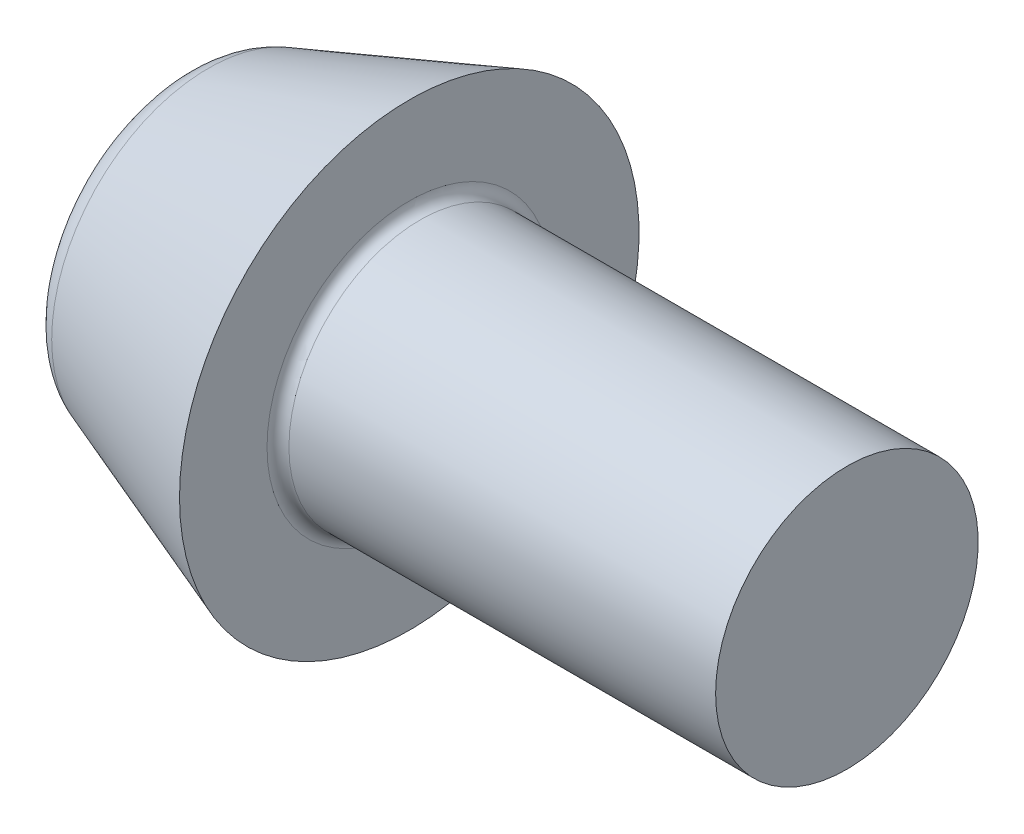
ISO-10303-21;
HEADER;
FILE_DESCRIPTION(('STEP AP214'),'2;1');
FILE_NAME('part.step','',(''),(''),'','','');
FILE_SCHEMA(('AUTOMOTIVE_DESIGN { 1 0 10303 214 1 1 1 1 }'));
ENDSEC;
DATA;
#1=APPLICATION_CONTEXT('core data for automotive mechanical design processes');
#2=APPLICATION_PROTOCOL_DEFINITION('international standard','automotive_design',2000,#1);
#3=PRODUCT_CONTEXT('',#1,'mechanical');
#4=PRODUCT('Part','Part','',(#3));
#5=PRODUCT_RELATED_PRODUCT_CATEGORY('part','',(#4));
#6=PRODUCT_DEFINITION_FORMATION('','',#4);
#7=PRODUCT_DEFINITION_CONTEXT('part definition',#1,'design');
#8=PRODUCT_DEFINITION('design','',#6,#7);
#9=PRODUCT_DEFINITION_SHAPE('','',#8);
#10=(LENGTH_UNIT() NAMED_UNIT(*) SI_UNIT(.MILLI.,.METRE.));
#11=(NAMED_UNIT(*) PLANE_ANGLE_UNIT() SI_UNIT($,.RADIAN.));
#12=(NAMED_UNIT(*) SI_UNIT($,.STERADIAN.) SOLID_ANGLE_UNIT());
#13=UNCERTAINTY_MEASURE_WITH_UNIT(LENGTH_MEASURE(1.E-05),#10,'distance_accuracy_value','');
#14=(GEOMETRIC_REPRESENTATION_CONTEXT(3) GLOBAL_UNCERTAINTY_ASSIGNED_CONTEXT((#13)) GLOBAL_UNIT_ASSIGNED_CONTEXT((#10,
#11,#12)) REPRESENTATION_CONTEXT('',''));
#15=CARTESIAN_POINT('',(0.,0.,0.));
#16=DIRECTION('',(0.,0.,1.));
#17=DIRECTION('',(1.,0.,0.));
#18=AXIS2_PLACEMENT_3D('',#15,#16,#17);
#19=CARTESIAN_POINT('',(0.,6.67831254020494,0.));
#20=DIRECTION('',(1.,0.,0.));
#21=DIRECTION('',(0.,0.,-1.));
#22=AXIS2_PLACEMENT_3D('',#19,#20,#21);
#23=PLANE('',#22);
#24=CARTESIAN_POINT('',(0.,0.,0.));
#25=DIRECTION('',(1.,0.,0.));
#26=DIRECTION('',(0.,0.,-1.));
#27=AXIS2_PLACEMENT_3D('',#24,#25,#26);
#28=CIRCLE('',#27,5.27789746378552);
#29=CARTESIAN_POINT('',(0.,0.,-5.27789746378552));
#30=VERTEX_POINT('',#29);
#31=EDGE_CURVE('E38',#30,#30,#28,.F.);
#32=ORIENTED_EDGE('',*,*,#31,.T.);
#33=EDGE_LOOP('',(#32));
#34=FACE_BOUND('',#33,.T.);
#35=ADVANCED_FACE('F31',(#34),#23,.F.);
#36=CARTESIAN_POINT('',(30.5,0.,0.));
#37=DIRECTION('',(-1.,0.,0.));
#38=DIRECTION('',(0.,0.,1.));
#39=AXIS2_PLACEMENT_3D('',#36,#37,#38);
#40=PLANE('',#39);
#41=CARTESIAN_POINT('',(30.5,0.,0.));
#42=DIRECTION('',(-1.,0.,0.));
#43=DIRECTION('',(0.,0.,1.));
#44=AXIS2_PLACEMENT_3D('',#41,#42,#43);
#45=CIRCLE('',#44,5.99999999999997);
#46=CARTESIAN_POINT('',(30.5,0.,5.99999999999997));
#47=VERTEX_POINT('',#46);
#48=EDGE_CURVE('E51',#47,#47,#45,.T.);
#49=ORIENTED_EDGE('',*,*,#48,.F.);
#50=EDGE_LOOP('',(#49));
#51=FACE_BOUND('',#50,.T.);
#52=ADVANCED_FACE('F71',(#51),#40,.F.);
#53=CARTESIAN_POINT('',(-26.4885714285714,0.,0.));
#54=DIRECTION('',(-1.,0.,0.));
#55=DIRECTION('',(0.,0.,1.));
#56=AXIS2_PLACEMENT_3D('',#53,#54,#55);
#57=CYLINDRICAL_SURFACE('',#56,5.99999999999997);
#58=CARTESIAN_POINT('',(11.,0.,0.));
#59=DIRECTION('',(-1.,0.,0.));
#60=DIRECTION('',(0.,0.,1.));
#61=AXIS2_PLACEMENT_3D('',#58,#59,#60);
#62=CIRCLE('',#61,5.99999999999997);
#63=CARTESIAN_POINT('',(11.,0.,5.99999999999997));
#64=VERTEX_POINT('',#63);
#65=EDGE_CURVE('E42',#64,#64,#62,.F.);
#66=ORIENTED_EDGE('',*,*,#65,.T.);
#67=EDGE_LOOP('',(#66));
#68=FACE_BOUND('',#67,.T.);
#69=ORIENTED_EDGE('',*,*,#48,.T.);
#70=EDGE_LOOP('',(#69));
#71=FACE_BOUND('',#70,.T.);
#72=ADVANCED_FACE('F62',(#68,#71),#57,.T.);
#73=CARTESIAN_POINT('',(10.5,5.99999999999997,0.));
#74=DIRECTION('',(-1.,0.,0.));
#75=DIRECTION('',(0.,0.,1.));
#76=AXIS2_PLACEMENT_3D('',#73,#74,#75);
#77=PLANE('',#76);
#78=CARTESIAN_POINT('',(10.5,0.,0.));
#79=DIRECTION('',(-1.,0.,0.));
#80=DIRECTION('',(0.,0.,1.));
#81=AXIS2_PLACEMENT_3D('',#78,#79,#80);
#82=CIRCLE('',#81,6.49999999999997);
#83=CARTESIAN_POINT('',(10.5,0.,6.49999999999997));
#84=VERTEX_POINT('',#83);
#85=EDGE_CURVE('E46',#84,#84,#82,.T.);
#86=ORIENTED_EDGE('',*,*,#85,.T.);
#87=EDGE_LOOP('',(#86));
#88=FACE_BOUND('',#87,.T.);
#89=CARTESIAN_POINT('',(10.5,0.,0.));
#90=DIRECTION('',(-1.,0.,0.));
#91=DIRECTION('',(0.,0.,1.));
#92=AXIS2_PLACEMENT_3D('',#89,#90,#91);
#93=CIRCLE('',#92,10.5);
#94=CARTESIAN_POINT('',(10.5,0.,10.5));
#95=VERTEX_POINT('',#94);
#96=EDGE_CURVE('E54',#95,#95,#93,.T.);
#97=ORIENTED_EDGE('',*,*,#96,.F.);
#98=EDGE_LOOP('',(#97));
#99=FACE_BOUND('',#98,.T.);
#100=ADVANCED_FACE('F60',(#88,#99),#77,.F.);
#101=CARTESIAN_POINT('',(10.5,0.,0.));
#102=DIRECTION('',(1.,0.,0.));
#103=DIRECTION('',(0.,0.,-1.));
#104=AXIS2_PLACEMENT_3D('',#101,#102,#103);
#105=CONICAL_SURFACE('',#104,10.5,0.34906585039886);
#106=CARTESIAN_POINT('',(1.31595971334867,0.,0.));
#107=DIRECTION('',(-1.,0.,0.));
#108=DIRECTION('',(0.,0.,1.));
#109=AXIS2_PLACEMENT_3D('',#106,#107,#108);
#110=CIRCLE('',#109,7.15728270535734);
#111=CARTESIAN_POINT('',(1.31595971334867,0.,7.15728270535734));
#112=VERTEX_POINT('',#111);
#113=EDGE_CURVE('E10',#112,#112,#110,.F.);
#114=ORIENTED_EDGE('',*,*,#113,.T.);
#115=EDGE_LOOP('',(#114));
#116=FACE_BOUND('',#115,.T.);
#117=ORIENTED_EDGE('',*,*,#96,.T.);
#118=EDGE_LOOP('',(#117));
#119=FACE_BOUND('',#118,.T.);
#120=ADVANCED_FACE('F58',(#116,#119),#105,.T.);
#121=CARTESIAN_POINT('',(11.,0.,0.));
#122=DIRECTION('',(-1.,0.,0.));
#123=DIRECTION('',(0.,0.,1.));
#124=AXIS2_PLACEMENT_3D('',#121,#122,#123);
#125=TOROIDAL_SURFACE('',#124,6.49999999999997,0.5);
#126=ORIENTED_EDGE('',*,*,#65,.F.);
#127=EDGE_LOOP('',(#126));
#128=FACE_BOUND('',#127,.T.);
#129=ORIENTED_EDGE('',*,*,#85,.F.);
#130=EDGE_LOOP('',(#129));
#131=FACE_BOUND('',#130,.T.);
#132=ADVANCED_FACE('F69',(#128,#131),#125,.F.);
#133=CARTESIAN_POINT('',(2.,0.,0.));
#134=DIRECTION('',(1.,0.,0.));
#135=DIRECTION('',(0.,0.,-1.));
#136=AXIS2_PLACEMENT_3D('',#133,#134,#135);
#137=TOROIDAL_SURFACE('',#136,5.27789746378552,2.);
#138=ORIENTED_EDGE('',*,*,#113,.F.);
#139=EDGE_LOOP('',(#138));
#140=FACE_BOUND('',#139,.T.);
#141=ORIENTED_EDGE('',*,*,#31,.F.);
#142=EDGE_LOOP('',(#141));
#143=FACE_BOUND('',#142,.T.);
#144=ADVANCED_FACE('F33',(#140,#143),#137,.T.);
#145=CLOSED_SHELL('',(#35,#52,#72,#100,#120,#132,#144));
#146=MANIFOLD_SOLID_BREP('B2',#145);
#147=ADVANCED_BREP_SHAPE_REPRESENTATION('',(#18,#146),#14);
#148=SHAPE_DEFINITION_REPRESENTATION(#9,#147);
ENDSEC;
END-ISO-10303-21;
